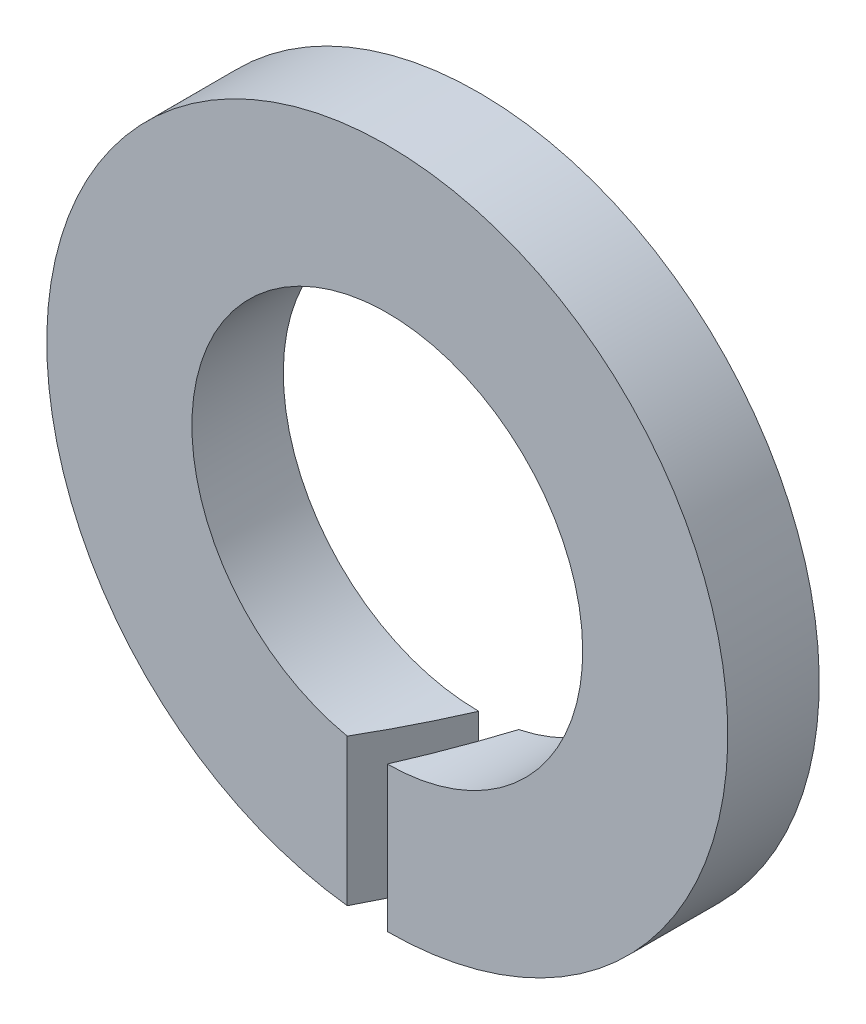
ISO-10303-21;
HEADER;
FILE_DESCRIPTION(('STEP AP214'),'2;1');
FILE_NAME('part.step','',(''),(''),'','','');
FILE_SCHEMA(('AUTOMOTIVE_DESIGN { 1 0 10303 214 1 1 1 1 }'));
ENDSEC;
DATA;
#1=APPLICATION_CONTEXT('core data for automotive mechanical design processes');
#2=APPLICATION_PROTOCOL_DEFINITION('international standard','automotive_design',2000,#1);
#3=PRODUCT_CONTEXT('',#1,'mechanical');
#4=PRODUCT('Part','Part','',(#3));
#5=PRODUCT_RELATED_PRODUCT_CATEGORY('part','',(#4));
#6=PRODUCT_DEFINITION_FORMATION('','',#4);
#7=PRODUCT_DEFINITION_CONTEXT('part definition',#1,'design');
#8=PRODUCT_DEFINITION('design','',#6,#7);
#9=PRODUCT_DEFINITION_SHAPE('','',#8);
#10=(LENGTH_UNIT() NAMED_UNIT(*) SI_UNIT(.MILLI.,.METRE.));
#11=(NAMED_UNIT(*) PLANE_ANGLE_UNIT() SI_UNIT($,.RADIAN.));
#12=(NAMED_UNIT(*) SI_UNIT($,.STERADIAN.) SOLID_ANGLE_UNIT());
#13=UNCERTAINTY_MEASURE_WITH_UNIT(LENGTH_MEASURE(1.E-05),#10,'distance_accuracy_value','');
#14=(GEOMETRIC_REPRESENTATION_CONTEXT(3) GLOBAL_UNCERTAINTY_ASSIGNED_CONTEXT((#13)) GLOBAL_UNIT_ASSIGNED_CONTEXT((#10,
#11,#12)) REPRESENTATION_CONTEXT('',''));
#15=CARTESIAN_POINT('',(0.,0.,0.));
#16=DIRECTION('',(0.,0.,1.));
#17=DIRECTION('',(1.,0.,0.));
#18=AXIS2_PLACEMENT_3D('',#15,#16,#17);
#19=CARTESIAN_POINT('',(0.,0.,0.));
#20=DIRECTION('',(0.,0.,-1.));
#21=DIRECTION('',(0.,1.,0.));
#22=AXIS2_PLACEMENT_3D('',#19,#20,#21);
#23=CYLINDRICAL_SURFACE('',#22,4.275);
#24=CARTESIAN_POINT('',(0.,0.,2.));
#25=DIRECTION('',(0.,0.,-1.));
#26=DIRECTION('',(0.,1.,0.));
#27=AXIS2_PLACEMENT_3D('',#24,#25,#26);
#28=CIRCLE('',#27,4.275);
#29=CARTESIAN_POINT('',(-0.876470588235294,-4.18418741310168,2.));
#30=VERTEX_POINT('',#29);
#31=CARTESIAN_POINT('',(0.,-4.275,2.));
#32=VERTEX_POINT('',#31);
#33=EDGE_CURVE('E10',#30,#32,#28,.T.);
#34=ORIENTED_EDGE('',*,*,#33,.F.);
#35=CARTESIAN_POINT('',(0.,0.,0.));
#36=DIRECTION('',(-0.915909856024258,0.,-0.401384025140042));
#37=DIRECTION('',(0.401384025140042,0.,-0.915909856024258));
#38=AXIS2_PLACEMENT_3D('',#35,#36,#37);
#39=ELLIPSE('',#38,10.6506480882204,4.275);
#40=CARTESIAN_POINT('',(0.,-4.275,0.));
#41=VERTEX_POINT('',#40);
#42=EDGE_CURVE('E78',#30,#41,#39,.F.);
#43=ORIENTED_EDGE('',*,*,#42,.T.);
#44=CARTESIAN_POINT('',(0.,0.,0.));
#45=DIRECTION('',(0.,0.,-1.));
#46=DIRECTION('',(0.,1.,0.));
#47=AXIS2_PLACEMENT_3D('',#44,#45,#46);
#48=CIRCLE('',#47,4.275);
#49=CARTESIAN_POINT('',(0.876470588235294,-4.18418741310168,0.));
#50=VERTEX_POINT('',#49);
#51=EDGE_CURVE('E73',#41,#50,#48,.T.);
#52=ORIENTED_EDGE('',*,*,#51,.T.);
#53=CARTESIAN_POINT('',(0.,0.,2.));
#54=DIRECTION('',(-0.915909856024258,0.,-0.401384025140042));
#55=DIRECTION('',(0.401384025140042,0.,-0.915909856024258));
#56=AXIS2_PLACEMENT_3D('',#53,#54,#55);
#57=ELLIPSE('',#56,10.6506480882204,4.275);
#58=EDGE_CURVE('E30',#32,#50,#57,.F.);
#59=ORIENTED_EDGE('',*,*,#58,.F.);
#60=EDGE_LOOP('',(#34,#43,#52,#59));
#61=FACE_BOUND('',#60,.T.);
#62=ADVANCED_FACE('F16',(#61),#23,.F.);
#63=CARTESIAN_POINT('',(7.45,0.,2.));
#64=DIRECTION('',(0.,0.,1.));
#65=DIRECTION('',(0.,-1.,0.));
#66=AXIS2_PLACEMENT_3D('',#63,#64,#65);
#67=PLANE('',#66);
#68=DIRECTION('',(0.,1.,0.));
#69=VECTOR('',#68,1.);
#70=CARTESIAN_POINT('',(-0.876470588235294,-7.7675,2.));
#71=LINE('',#70,#69);
#72=CARTESIAN_POINT('',(-0.876470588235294,-7.3982632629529,2.));
#73=VERTEX_POINT('',#72);
#74=EDGE_CURVE('E63',#73,#30,#71,.T.);
#75=ORIENTED_EDGE('',*,*,#74,.T.);
#76=ORIENTED_EDGE('',*,*,#33,.T.);
#77=DIRECTION('',(0.,1.,0.));
#78=VECTOR('',#77,1.);
#79=CARTESIAN_POINT('',(0.,-7.7675,2.));
#80=LINE('',#79,#78);
#81=CARTESIAN_POINT('',(0.,-7.45,2.));
#82=VERTEX_POINT('',#81);
#83=EDGE_CURVE('E57',#82,#32,#80,.T.);
#84=ORIENTED_EDGE('',*,*,#83,.F.);
#85=CARTESIAN_POINT('',(0.,0.,2.));
#86=DIRECTION('',(0.,0.,-1.));
#87=DIRECTION('',(0.,1.,0.));
#88=AXIS2_PLACEMENT_3D('',#85,#86,#87);
#89=CIRCLE('',#88,7.45);
#90=EDGE_CURVE('E23',#73,#82,#89,.T.);
#91=ORIENTED_EDGE('',*,*,#90,.F.);
#92=EDGE_LOOP('',(#75,#76,#84,#91));
#93=FACE_BOUND('',#92,.T.);
#94=ADVANCED_FACE('F68',(#93),#67,.T.);
#95=CARTESIAN_POINT('',(0.,0.,0.));
#96=DIRECTION('',(0.,0.,-1.));
#97=DIRECTION('',(0.,1.,0.));
#98=AXIS2_PLACEMENT_3D('',#95,#96,#97);
#99=CYLINDRICAL_SURFACE('',#98,7.45);
#100=CARTESIAN_POINT('',(0.,0.,0.));
#101=DIRECTION('',(-0.915909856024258,0.,-0.401384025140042));
#102=DIRECTION('',(0.401384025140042,0.,-0.915909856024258));
#103=AXIS2_PLACEMENT_3D('',#100,#101,#102);
#104=ELLIPSE('',#103,18.5607785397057,7.45);
#105=CARTESIAN_POINT('',(0.,-7.45,0.));
#106=VERTEX_POINT('',#105);
#107=EDGE_CURVE('E38',#73,#106,#104,.F.);
#108=ORIENTED_EDGE('',*,*,#107,.F.);
#109=ORIENTED_EDGE('',*,*,#90,.T.);
#110=CARTESIAN_POINT('',(0.,0.,2.));
#111=DIRECTION('',(-0.915909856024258,0.,-0.401384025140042));
#112=DIRECTION('',(0.401384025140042,0.,-0.915909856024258));
#113=AXIS2_PLACEMENT_3D('',#110,#111,#112);
#114=ELLIPSE('',#113,18.5607785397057,7.45);
#115=CARTESIAN_POINT('',(0.876470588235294,-7.3982632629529,0.));
#116=VERTEX_POINT('',#115);
#117=EDGE_CURVE('E54',#82,#116,#114,.F.);
#118=ORIENTED_EDGE('',*,*,#117,.T.);
#119=CARTESIAN_POINT('',(0.,0.,0.));
#120=DIRECTION('',(0.,0.,-1.));
#121=DIRECTION('',(0.,1.,0.));
#122=AXIS2_PLACEMENT_3D('',#119,#120,#121);
#123=CIRCLE('',#122,7.45);
#124=EDGE_CURVE('E72',#106,#116,#123,.T.);
#125=ORIENTED_EDGE('',*,*,#124,.F.);
#126=EDGE_LOOP('',(#108,#109,#118,#125));
#127=FACE_BOUND('',#126,.T.);
#128=ADVANCED_FACE('F71',(#127),#99,.T.);
#129=CARTESIAN_POINT('',(4.275,0.,0.));
#130=DIRECTION('',(0.,0.,-1.));
#131=DIRECTION('',(0.,1.,0.));
#132=AXIS2_PLACEMENT_3D('',#129,#130,#131);
#133=PLANE('',#132);
#134=DIRECTION('',(0.,1.,0.));
#135=VECTOR('',#134,1.);
#136=CARTESIAN_POINT('',(0.,-7.7675,0.));
#137=LINE('',#136,#135);
#138=EDGE_CURVE('E83',#106,#41,#137,.T.);
#139=ORIENTED_EDGE('',*,*,#138,.F.);
#140=ORIENTED_EDGE('',*,*,#124,.T.);
#141=DIRECTION('',(0.,1.,0.));
#142=VECTOR('',#141,1.);
#143=CARTESIAN_POINT('',(0.876470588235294,-7.7675,0.));
#144=LINE('',#143,#142);
#145=EDGE_CURVE('E58',#116,#50,#144,.T.);
#146=ORIENTED_EDGE('',*,*,#145,.T.);
#147=ORIENTED_EDGE('',*,*,#51,.F.);
#148=EDGE_LOOP('',(#139,#140,#146,#147));
#149=FACE_BOUND('',#148,.T.);
#150=ADVANCED_FACE('F89',(#149),#133,.T.);
#151=CARTESIAN_POINT('',(0.876470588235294,-7.7675,0.));
#152=DIRECTION('',(-0.915909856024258,0.,-0.401384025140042));
#153=DIRECTION('',(0.401384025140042,0.,-0.915909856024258));
#154=AXIS2_PLACEMENT_3D('',#151,#152,#153);
#155=PLANE('',#154);
#156=ORIENTED_EDGE('',*,*,#58,.T.);
#157=ORIENTED_EDGE('',*,*,#145,.F.);
#158=ORIENTED_EDGE('',*,*,#117,.F.);
#159=ORIENTED_EDGE('',*,*,#83,.T.);
#160=EDGE_LOOP('',(#156,#157,#158,#159));
#161=FACE_BOUND('',#160,.T.);
#162=ADVANCED_FACE('F56',(#161),#155,.T.);
#163=CARTESIAN_POINT('',(0.,-7.7675,0.));
#164=DIRECTION('',(-0.915909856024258,0.,-0.401384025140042));
#165=DIRECTION('',(0.401384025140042,0.,-0.915909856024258));
#166=AXIS2_PLACEMENT_3D('',#163,#164,#165);
#167=PLANE('',#166);
#168=ORIENTED_EDGE('',*,*,#74,.F.);
#169=ORIENTED_EDGE('',*,*,#107,.T.);
#170=ORIENTED_EDGE('',*,*,#138,.T.);
#171=ORIENTED_EDGE('',*,*,#42,.F.);
#172=EDGE_LOOP('',(#168,#169,#170,#171));
#173=FACE_BOUND('',#172,.T.);
#174=ADVANCED_FACE('F90',(#173),#167,.F.);
#175=CLOSED_SHELL('',(#62,#94,#128,#150,#162,#174));
#176=MANIFOLD_SOLID_BREP('B1',#175);
#177=ADVANCED_BREP_SHAPE_REPRESENTATION('',(#18,#176),#14);
#178=SHAPE_DEFINITION_REPRESENTATION(#9,#177);
ENDSEC;
END-ISO-10303-21;
